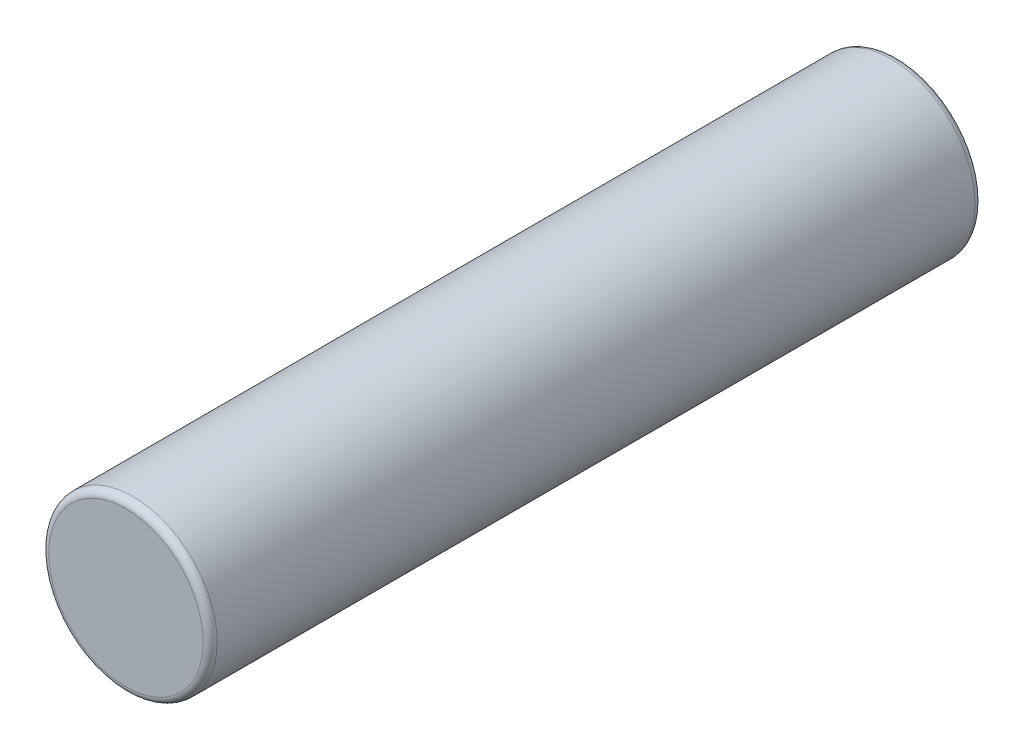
from build123d import *

# Parameters (mm, degrees)
SCHIZZO1_R                   = 12
ESTRUSIONE_ESTRUSIONE1_DEPTH = 55
RACCORDO1_R                  = 1


with BuildPart() as part:
    # Schizzo1 → Estrusione-Estrusione1 (new, symmetric)
    with BuildSketch(Plane.XY):
        Circle(SCHIZZO1_R)
    extrude(amount=ESTRUSIONE_ESTRUSIONE1_DEPTH, both=True)

    # Raccordo1
    raccordo1_edges = [part.edges().sort_by_distance(p)[0] for p in [
        (-12, 0, -55),
        (-12, 0, 55),
    ]]
    fillet(raccordo1_edges, radius=RACCORDO1_R)


solid = part.part
